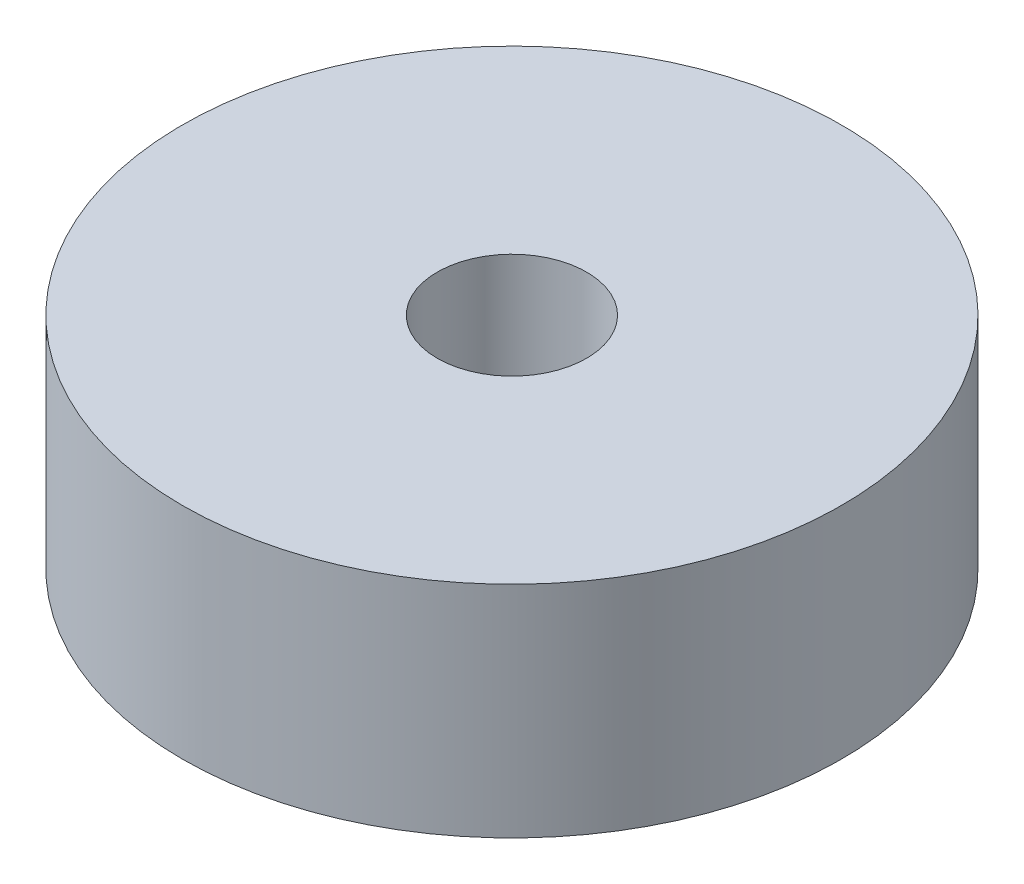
ISO-10303-21;
HEADER;
FILE_DESCRIPTION(('STEP AP214'),'2;1');
FILE_NAME('part.step','',(''),(''),'','','');
FILE_SCHEMA(('AUTOMOTIVE_DESIGN { 1 0 10303 214 1 1 1 1 }'));
ENDSEC;
DATA;
#1=APPLICATION_CONTEXT('core data for automotive mechanical design processes');
#2=APPLICATION_PROTOCOL_DEFINITION('international standard','automotive_design',2000,#1);
#3=PRODUCT_CONTEXT('',#1,'mechanical');
#4=PRODUCT('Part','Part','',(#3));
#5=PRODUCT_RELATED_PRODUCT_CATEGORY('part','',(#4));
#6=PRODUCT_DEFINITION_FORMATION('','',#4);
#7=PRODUCT_DEFINITION_CONTEXT('part definition',#1,'design');
#8=PRODUCT_DEFINITION('design','',#6,#7);
#9=PRODUCT_DEFINITION_SHAPE('','',#8);
#10=(LENGTH_UNIT() NAMED_UNIT(*) SI_UNIT(.MILLI.,.METRE.));
#11=(NAMED_UNIT(*) PLANE_ANGLE_UNIT() SI_UNIT($,.RADIAN.));
#12=(NAMED_UNIT(*) SI_UNIT($,.STERADIAN.) SOLID_ANGLE_UNIT());
#13=UNCERTAINTY_MEASURE_WITH_UNIT(LENGTH_MEASURE(1.E-05),#10,'distance_accuracy_value','');
#14=(GEOMETRIC_REPRESENTATION_CONTEXT(3) GLOBAL_UNCERTAINTY_ASSIGNED_CONTEXT((#13)) GLOBAL_UNIT_ASSIGNED_CONTEXT((#10,
#11,#12)) REPRESENTATION_CONTEXT('',''));
#15=CARTESIAN_POINT('',(0.,0.,0.));
#16=DIRECTION('',(0.,0.,1.));
#17=DIRECTION('',(1.,0.,0.));
#18=AXIS2_PLACEMENT_3D('',#15,#16,#17);
#19=CARTESIAN_POINT('',(0.,10.,1.59594559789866E-13));
#20=DIRECTION('',(0.,1.,0.));
#21=DIRECTION('',(0.,0.,1.));
#22=AXIS2_PLACEMENT_3D('',#19,#20,#21);
#23=PLANE('',#22);
#24=CARTESIAN_POINT('',(0.,10.,1.59594559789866E-13));
#25=DIRECTION('',(0.,1.,0.));
#26=DIRECTION('',(0.,0.,1.));
#27=AXIS2_PLACEMENT_3D('',#24,#25,#26);
#28=CIRCLE('',#27,15.);
#29=CARTESIAN_POINT('',(0.,10.,15.0000000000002));
#30=VERTEX_POINT('',#29);
#31=EDGE_CURVE('E10',#30,#30,#28,.T.);
#32=ORIENTED_EDGE('',*,*,#31,.T.);
#33=EDGE_LOOP('',(#32));
#34=FACE_BOUND('',#33,.T.);
#35=CARTESIAN_POINT('',(0.,10.,1.59594559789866E-13));
#36=DIRECTION('',(0.,1.,0.));
#37=DIRECTION('',(0.,0.,1.));
#38=AXIS2_PLACEMENT_3D('',#35,#36,#37);
#39=CIRCLE('',#38,3.4);
#40=CARTESIAN_POINT('',(0.,10.,3.40000000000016));
#41=VERTEX_POINT('',#40);
#42=EDGE_CURVE('E50',#41,#41,#39,.T.);
#43=ORIENTED_EDGE('',*,*,#42,.F.);
#44=EDGE_LOOP('',(#43));
#45=FACE_BOUND('',#44,.T.);
#46=ADVANCED_FACE('F36',(#34,#45),#23,.T.);
#47=CARTESIAN_POINT('',(0.,0.,1.66533453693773E-13));
#48=DIRECTION('',(0.,1.,0.));
#49=DIRECTION('',(0.,0.,1.));
#50=AXIS2_PLACEMENT_3D('',#47,#48,#49);
#51=PLANE('',#50);
#52=CARTESIAN_POINT('',(0.,0.,1.66533453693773E-13));
#53=DIRECTION('',(0.,1.,0.));
#54=DIRECTION('',(0.,0.,1.));
#55=AXIS2_PLACEMENT_3D('',#52,#53,#54);
#56=CIRCLE('',#55,15.);
#57=CARTESIAN_POINT('',(0.,0.,15.0000000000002));
#58=VERTEX_POINT('',#57);
#59=EDGE_CURVE('E44',#58,#58,#56,.T.);
#60=ORIENTED_EDGE('',*,*,#59,.F.);
#61=EDGE_LOOP('',(#60));
#62=FACE_BOUND('',#61,.T.);
#63=CARTESIAN_POINT('',(0.,0.,1.66533453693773E-13));
#64=DIRECTION('',(0.,1.,0.));
#65=DIRECTION('',(0.,0.,1.));
#66=AXIS2_PLACEMENT_3D('',#63,#64,#65);
#67=CIRCLE('',#66,3.4);
#68=CARTESIAN_POINT('',(0.,0.,3.40000000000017));
#69=VERTEX_POINT('',#68);
#70=EDGE_CURVE('E55',#69,#69,#67,.T.);
#71=ORIENTED_EDGE('',*,*,#70,.T.);
#72=EDGE_LOOP('',(#71));
#73=FACE_BOUND('',#72,.T.);
#74=ADVANCED_FACE('F61',(#62,#73),#51,.F.);
#75=CARTESIAN_POINT('',(0.,10.,1.59594559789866E-13));
#76=DIRECTION('',(0.,-1.,0.));
#77=DIRECTION('',(0.,0.,-1.));
#78=AXIS2_PLACEMENT_3D('',#75,#76,#77);
#79=CYLINDRICAL_SURFACE('',#78,15.);
#80=ORIENTED_EDGE('',*,*,#31,.F.);
#81=EDGE_LOOP('',(#80));
#82=FACE_BOUND('',#81,.T.);
#83=ORIENTED_EDGE('',*,*,#59,.T.);
#84=EDGE_LOOP('',(#83));
#85=FACE_BOUND('',#84,.T.);
#86=ADVANCED_FACE('F38',(#82,#85),#79,.T.);
#87=CARTESIAN_POINT('',(0.,10.,1.59594559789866E-13));
#88=DIRECTION('',(0.,-1.,0.));
#89=DIRECTION('',(0.,0.,-1.));
#90=AXIS2_PLACEMENT_3D('',#87,#88,#89);
#91=CYLINDRICAL_SURFACE('',#90,3.4);
#92=ORIENTED_EDGE('',*,*,#42,.T.);
#93=EDGE_LOOP('',(#92));
#94=FACE_BOUND('',#93,.T.);
#95=ORIENTED_EDGE('',*,*,#70,.F.);
#96=EDGE_LOOP('',(#95));
#97=FACE_BOUND('',#96,.T.);
#98=ADVANCED_FACE('F63',(#94,#97),#91,.F.);
#99=CLOSED_SHELL('',(#46,#74,#86,#98));
#100=MANIFOLD_SOLID_BREP('B2',#99);
#101=ADVANCED_BREP_SHAPE_REPRESENTATION('',(#18,#100),#14);
#102=SHAPE_DEFINITION_REPRESENTATION(#9,#101);
ENDSEC;
END-ISO-10303-21;
